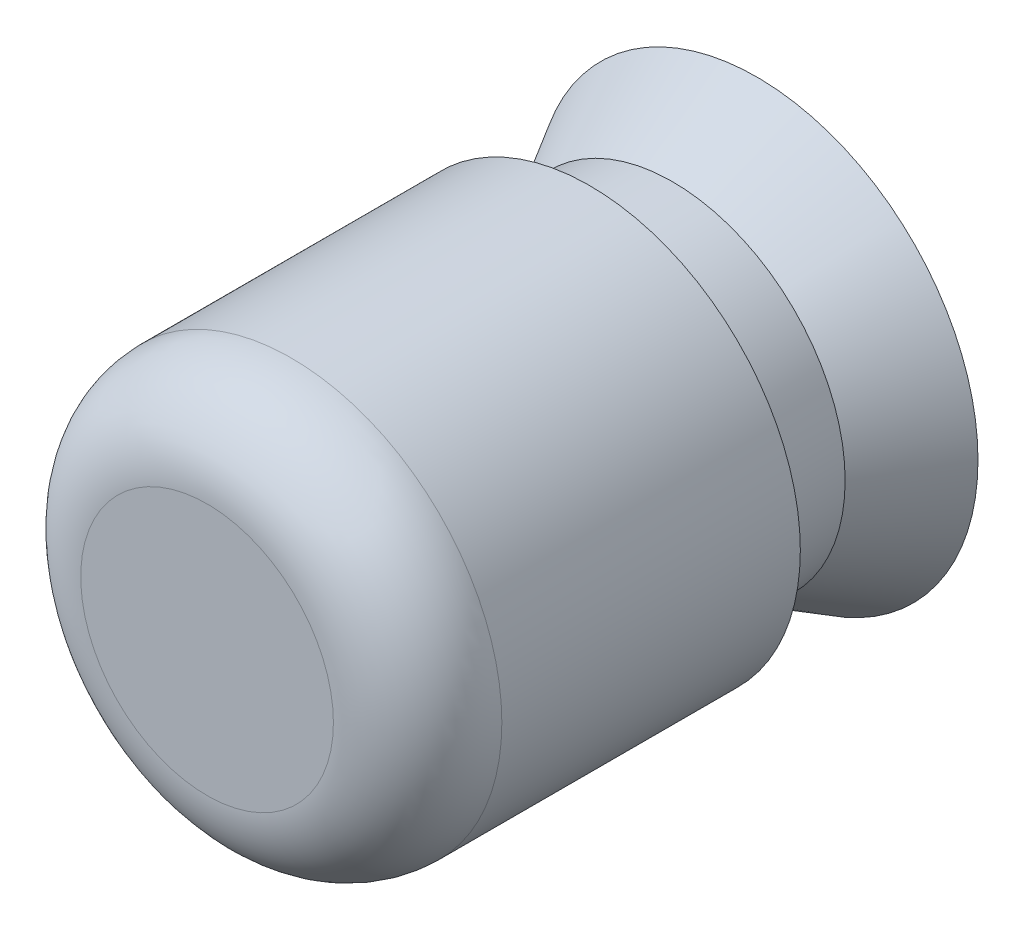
ISO-10303-21;
HEADER;
FILE_DESCRIPTION(('STEP AP214'),'2;1');
FILE_NAME('part.step','',(''),(''),'','','');
FILE_SCHEMA(('AUTOMOTIVE_DESIGN { 1 0 10303 214 1 1 1 1 }'));
ENDSEC;
DATA;
#1=APPLICATION_CONTEXT('core data for automotive mechanical design processes');
#2=APPLICATION_PROTOCOL_DEFINITION('international standard','automotive_design',2000,#1);
#3=PRODUCT_CONTEXT('',#1,'mechanical');
#4=PRODUCT('Part','Part','',(#3));
#5=PRODUCT_RELATED_PRODUCT_CATEGORY('part','',(#4));
#6=PRODUCT_DEFINITION_FORMATION('','',#4);
#7=PRODUCT_DEFINITION_CONTEXT('part definition',#1,'design');
#8=PRODUCT_DEFINITION('design','',#6,#7);
#9=PRODUCT_DEFINITION_SHAPE('','',#8);
#10=(LENGTH_UNIT() NAMED_UNIT(*) SI_UNIT(.MILLI.,.METRE.));
#11=(NAMED_UNIT(*) PLANE_ANGLE_UNIT() SI_UNIT($,.RADIAN.));
#12=(NAMED_UNIT(*) SI_UNIT($,.STERADIAN.) SOLID_ANGLE_UNIT());
#13=UNCERTAINTY_MEASURE_WITH_UNIT(LENGTH_MEASURE(1.E-05),#10,'distance_accuracy_value','');
#14=(GEOMETRIC_REPRESENTATION_CONTEXT(3) GLOBAL_UNCERTAINTY_ASSIGNED_CONTEXT((#13)) GLOBAL_UNIT_ASSIGNED_CONTEXT((#10,
#11,#12)) REPRESENTATION_CONTEXT('',''));
#15=CARTESIAN_POINT('',(0.,0.,0.));
#16=DIRECTION('',(0.,0.,1.));
#17=DIRECTION('',(1.,0.,0.));
#18=AXIS2_PLACEMENT_3D('',#15,#16,#17);
#19=CARTESIAN_POINT('',(0.,0.,0.));
#20=DIRECTION('',(0.,0.,-1.));
#21=DIRECTION('',(-1.,0.,0.));
#22=AXIS2_PLACEMENT_3D('',#19,#20,#21);
#23=PLANE('',#22);
#24=CARTESIAN_POINT('',(0.,0.,0.));
#25=DIRECTION('',(0.,0.,1.));
#26=DIRECTION('',(1.,0.,0.));
#27=AXIS2_PLACEMENT_3D('',#24,#25,#26);
#28=CIRCLE('',#27,1.19062499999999);
#29=CARTESIAN_POINT('',(1.19062499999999,0.,0.));
#30=VERTEX_POINT('',#29);
#31=EDGE_CURVE('E10',#30,#30,#28,.T.);
#32=ORIENTED_EDGE('',*,*,#31,.T.);
#33=EDGE_LOOP('',(#32));
#34=FACE_BOUND('',#33,.T.);
#35=ADVANCED_FACE('F33',(#34),#23,.F.);
#36=CARTESIAN_POINT('',(0.,0.,-0.79375));
#37=DIRECTION('',(0.,0.,1.));
#38=DIRECTION('',(1.,0.,0.));
#39=AXIS2_PLACEMENT_3D('',#36,#37,#38);
#40=TOROIDAL_SURFACE('',#39,1.190625,0.79375);
#41=ORIENTED_EDGE('',*,*,#31,.F.);
#42=EDGE_LOOP('',(#41));
#43=FACE_BOUND('',#42,.T.);
#44=CARTESIAN_POINT('',(0.,0.,-0.793750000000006));
#45=DIRECTION('',(0.,0.,1.));
#46=DIRECTION('',(1.,0.,0.));
#47=AXIS2_PLACEMENT_3D('',#44,#45,#46);
#48=CIRCLE('',#47,1.984375);
#49=CARTESIAN_POINT('',(1.984375,0.,-0.793750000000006));
#50=VERTEX_POINT('',#49);
#51=EDGE_CURVE('E39',#50,#50,#48,.T.);
#52=ORIENTED_EDGE('',*,*,#51,.T.);
#53=EDGE_LOOP('',(#52));
#54=FACE_BOUND('',#53,.T.);
#55=ADVANCED_FACE('F71',(#43,#54),#40,.T.);
#56=CARTESIAN_POINT('',(0.,0.,0.));
#57=DIRECTION('',(0.,0.,1.));
#58=DIRECTION('',(1.,0.,0.));
#59=AXIS2_PLACEMENT_3D('',#56,#57,#58);
#60=CYLINDRICAL_SURFACE('',#59,1.984375);
#61=ORIENTED_EDGE('',*,*,#51,.F.);
#62=EDGE_LOOP('',(#61));
#63=FACE_BOUND('',#62,.T.);
#64=CARTESIAN_POINT('',(0.,0.,-3.6068));
#65=DIRECTION('',(0.,0.,1.));
#66=DIRECTION('',(1.,0.,0.));
#67=AXIS2_PLACEMENT_3D('',#64,#65,#66);
#68=CIRCLE('',#67,1.984375);
#69=CARTESIAN_POINT('',(1.984375,0.,-3.6068));
#70=VERTEX_POINT('',#69);
#71=EDGE_CURVE('E43',#70,#70,#68,.T.);
#72=ORIENTED_EDGE('',*,*,#71,.T.);
#73=EDGE_LOOP('',(#72));
#74=FACE_BOUND('',#73,.T.);
#75=ADVANCED_FACE('F75',(#63,#74),#60,.T.);
#76=CARTESIAN_POINT('',(0.,1.984375,-3.6068));
#77=DIRECTION('',(0.,0.,1.));
#78=DIRECTION('',(1.,0.,0.));
#79=AXIS2_PLACEMENT_3D('',#76,#77,#78);
#80=PLANE('',#79);
#81=ORIENTED_EDGE('',*,*,#71,.F.);
#82=EDGE_LOOP('',(#81));
#83=FACE_BOUND('',#82,.T.);
#84=CARTESIAN_POINT('',(0.,0.,-3.6068));
#85=DIRECTION('',(0.,0.,1.));
#86=DIRECTION('',(1.,0.,0.));
#87=AXIS2_PLACEMENT_3D('',#84,#85,#86);
#88=CIRCLE('',#87,1.6256);
#89=CARTESIAN_POINT('',(1.6256,0.,-3.6068));
#90=VERTEX_POINT('',#89);
#91=EDGE_CURVE('E47',#90,#90,#88,.T.);
#92=ORIENTED_EDGE('',*,*,#91,.T.);
#93=EDGE_LOOP('',(#92));
#94=FACE_BOUND('',#93,.T.);
#95=ADVANCED_FACE('F80',(#83,#94),#80,.F.);
#96=CARTESIAN_POINT('',(0.,0.,0.));
#97=DIRECTION('',(0.,0.,1.));
#98=DIRECTION('',(1.,0.,0.));
#99=AXIS2_PLACEMENT_3D('',#96,#97,#98);
#100=CYLINDRICAL_SURFACE('',#99,1.6256);
#101=ORIENTED_EDGE('',*,*,#91,.F.);
#102=EDGE_LOOP('',(#101));
#103=FACE_BOUND('',#102,.T.);
#104=CARTESIAN_POINT('',(0.,0.,-4.38785));
#105=DIRECTION('',(0.,0.,1.));
#106=DIRECTION('',(1.,0.,0.));
#107=AXIS2_PLACEMENT_3D('',#104,#105,#106);
#108=CIRCLE('',#107,1.6256);
#109=CARTESIAN_POINT('',(1.6256,0.,-4.38785));
#110=VERTEX_POINT('',#109);
#111=EDGE_CURVE('E52',#110,#110,#108,.T.);
#112=ORIENTED_EDGE('',*,*,#111,.T.);
#113=EDGE_LOOP('',(#112));
#114=FACE_BOUND('',#113,.T.);
#115=ADVANCED_FACE('F67',(#103,#114),#100,.T.);
#116=CARTESIAN_POINT('',(0.,0.,-5.1816));
#117=DIRECTION('',(0.,0.,-1.));
#118=DIRECTION('',(-1.,0.,0.));
#119=AXIS2_PLACEMENT_3D('',#116,#117,#118);
#120=CONICAL_SURFACE('',#119,2.08387177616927,0.523598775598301);
#121=ORIENTED_EDGE('',*,*,#111,.F.);
#122=EDGE_LOOP('',(#121));
#123=FACE_BOUND('',#122,.T.);
#124=CARTESIAN_POINT('',(0.,0.,-5.1816));
#125=DIRECTION('',(0.,0.,1.));
#126=DIRECTION('',(1.,0.,0.));
#127=AXIS2_PLACEMENT_3D('',#124,#125,#126);
#128=CIRCLE('',#127,2.08387177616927);
#129=CARTESIAN_POINT('',(2.08387177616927,0.,-5.1816));
#130=VERTEX_POINT('',#129);
#131=EDGE_CURVE('E55',#130,#130,#128,.T.);
#132=ORIENTED_EDGE('',*,*,#131,.T.);
#133=EDGE_LOOP('',(#132));
#134=FACE_BOUND('',#133,.T.);
#135=ADVANCED_FACE('F59',(#123,#134),#120,.T.);
#136=CARTESIAN_POINT('',(0.,2.08387177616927,-5.1816));
#137=DIRECTION('',(0.,0.,1.));
#138=DIRECTION('',(1.,0.,0.));
#139=AXIS2_PLACEMENT_3D('',#136,#137,#138);
#140=PLANE('',#139);
#141=ORIENTED_EDGE('',*,*,#131,.F.);
#142=EDGE_LOOP('',(#141));
#143=FACE_BOUND('',#142,.T.);
#144=ADVANCED_FACE('F61',(#143),#140,.F.);
#145=CLOSED_SHELL('',(#35,#55,#75,#95,#115,#135,#144));
#146=MANIFOLD_SOLID_BREP('B2',#145);
#147=ADVANCED_BREP_SHAPE_REPRESENTATION('',(#18,#146),#14);
#148=SHAPE_DEFINITION_REPRESENTATION(#9,#147);
ENDSEC;
END-ISO-10303-21;
